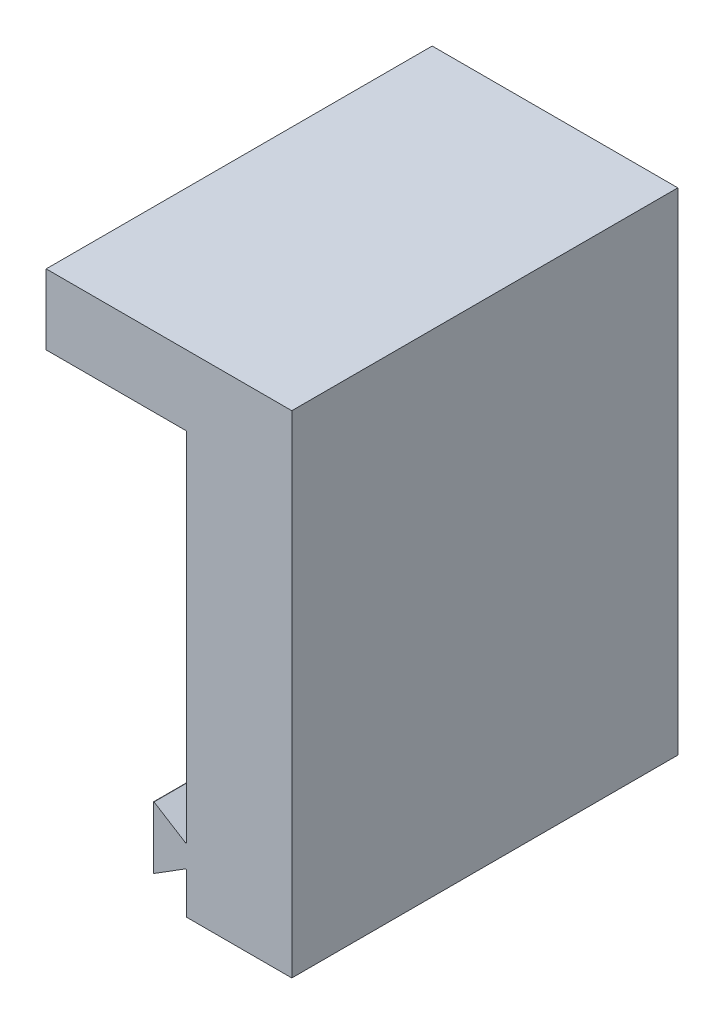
from build123d import *

# Parameters (mm, degrees)
BOSS_EXTRUDE3_DEPTH = 110
FILLET2_R           = 0.1
SKETCH3_W           = 70
SKETCH3_H           = 110
BOSS_EXTRUDE4_DEPTH = 20
SKETCH4_W           = 10
SKETCH4_H           = 10
CUT_EXTRUDE1_DEPTH  = 140


with BuildPart() as part:
    # Sketch1 → Boss-Extrude3 (new body)
    with BuildSketch(Plane.XY):
        Polygon((10.002090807, -115), (0, -108.75), (0, -120), (30, -120), (30, 0), (0, 0), (0, -101.25), (10.002090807, -95), align=None)
        Polygon((0, -108.241171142), (0, -108.75), (10.002090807, -115), (10.002090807, -95), (0, -101.25), (0, -101.758828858), align=None)
        Polygon((-0.317951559, -108.241171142), (0, -108.241171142), (0, -101.758828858), (-0.317951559, -101.758828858), (-9.402090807, -96.082428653), (-9.402090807, -113.917571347), align=None)
    extrude(amount=BOSS_EXTRUDE3_DEPTH)

    # Fillet2
    fillet2_edges = [part.edges().sort_by_distance(p)[0] for p in [
        (-9.402090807, -113.917571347, 55),
        (-9.402090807, -96.082428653, 55),
    ]]
    fillet(fillet2_edges, radius=FILLET2_R)

    # Sketch3 → Boss-Extrude4 (add)
    with BuildSketch(Plane(origin=(0, 0, 0), x_dir=(1, 0, 0), z_dir=(0, 1, 0))):
        with Locations((-5, -55)):
            Rectangle(SKETCH3_W, SKETCH3_H)
    extrude(amount=BOSS_EXTRUDE4_DEPTH)

    # Sketch4 → Cut-Extrude1 (cut)
    with BuildSketch(Plane.XZ):
        with Locations((-5, 30)):
            Rectangle(SKETCH4_W, SKETCH4_H)
        with Locations((-5, 80)):
            Rectangle(SKETCH4_W, SKETCH4_H)
    extrude(amount=CUT_EXTRUDE1_DEPTH, mode=Mode.SUBTRACT)


solid = part.part
